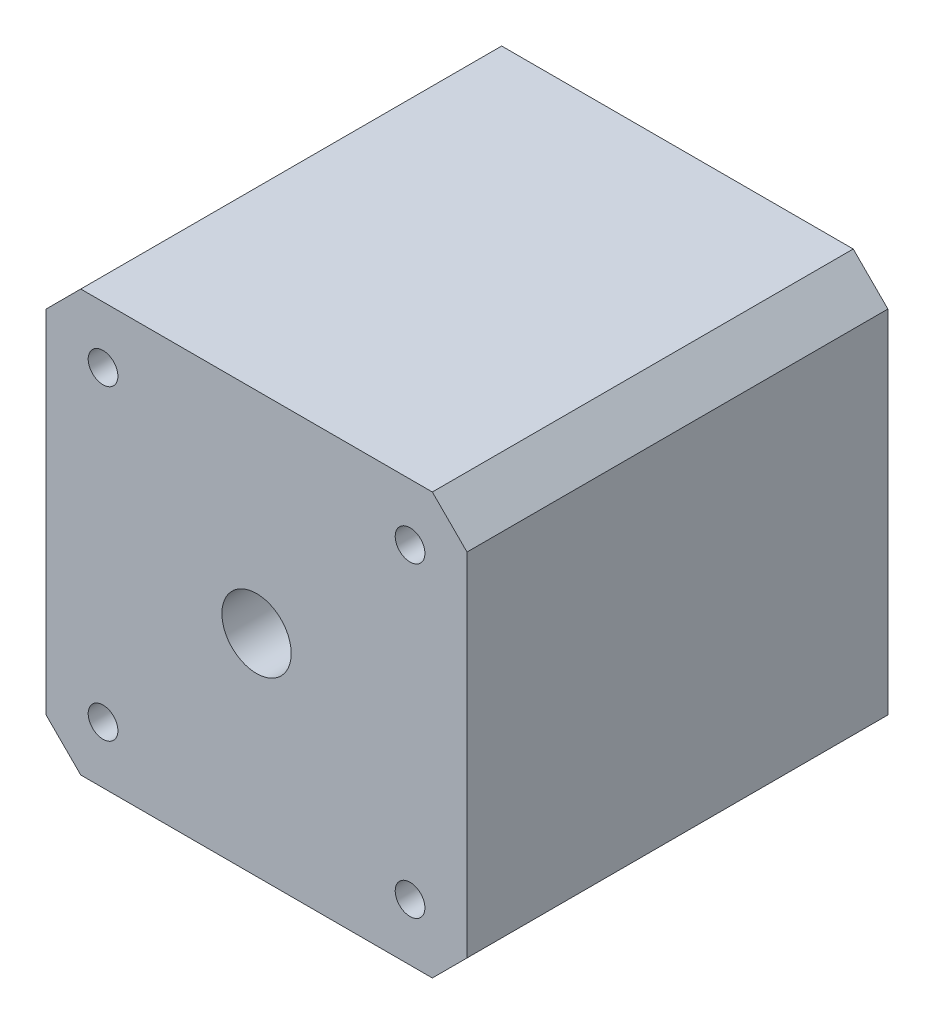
from build123d import *

# Parameters (mm, degrees)
EXTRUDE_1_DEPTH          = 42.5
SKETCH_2_R               = 3.5
CUT_EXTRUDE_1_DEPTH      = 42.5
SKETCH_3_R               = 1.5
CUT_EXTRUDE_2_DEPTH      = 42.5
PATTERN_CIRCULAR_1_COUNT = 4


with BuildPart() as part:
    # Sketch 1 → Extrude 1 (new body)
    with BuildSketch(Plane.XY):
        Polygon((-21.25, 17.75), (-17.75, 21.25), (17.75, 21.25), (21.25, 17.75), (21.25, -17.75), (17.75, -21.25), (-17.75, -21.25), (-21.25, -17.75), align=None)
    extrude(amount=EXTRUDE_1_DEPTH)

    # Sketch 2 → Cut-Extrude 1 (cut)
    with BuildSketch(Plane(origin=(0, 0, 0), x_dir=(-1, 0, 0), z_dir=(0, 0, -1))):
        Circle(SKETCH_2_R)
    extrude(amount=-CUT_EXTRUDE_1_DEPTH, mode=Mode.SUBTRACT)

    # Sketch 3 → Cut-Extrude 2 (cut)
    with BuildSketch(Plane(origin=(0, 0, 0), x_dir=(-1, 0, 0), z_dir=(0, 0, -1))):
        with Locations((-15.5, 15.5)):
            Circle(SKETCH_3_R)
        with Locations((-15.5, -15.5)):
            Circle(SKETCH_3_R)
    cut_extrude_2 = extrude(amount=-CUT_EXTRUDE_2_DEPTH, mode=Mode.SUBTRACT)

    # Pattern Circular 1: Cut-Extrude 2 ×4 about axis
    pattern_circular_1_axis = Axis((0, 0, 0), (0, 0, 1))
    for i in range(1, PATTERN_CIRCULAR_1_COUNT):
        add(cut_extrude_2.rotate(pattern_circular_1_axis, i * 360 / PATTERN_CIRCULAR_1_COUNT), mode=Mode.SUBTRACT)


solid = part.part
